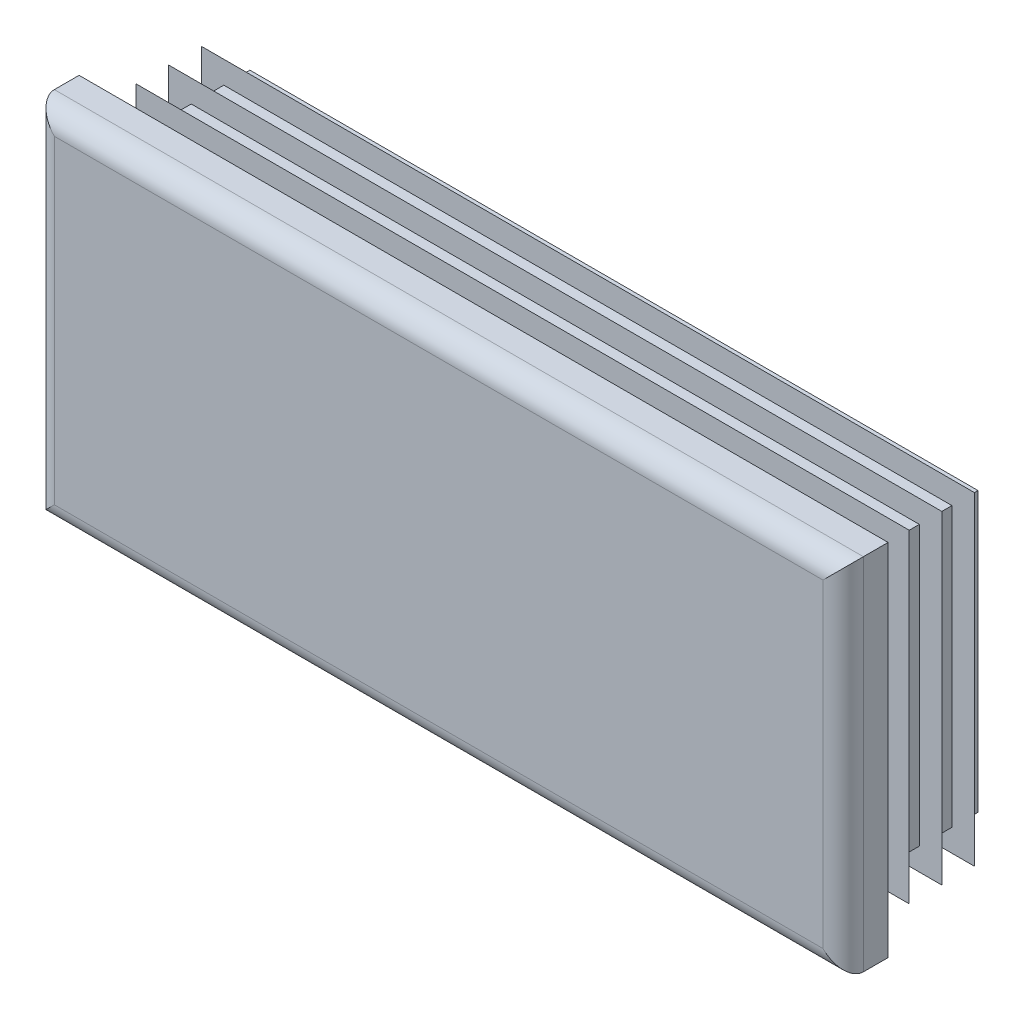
ISO-10303-21;
HEADER;
FILE_DESCRIPTION(('STEP AP214'),'2;1');
FILE_NAME('part.step','',(''),(''),'','','');
FILE_SCHEMA(('AUTOMOTIVE_DESIGN { 1 0 10303 214 1 1 1 1 }'));
ENDSEC;
DATA;
#1=APPLICATION_CONTEXT('core data for automotive mechanical design processes');
#2=APPLICATION_PROTOCOL_DEFINITION('international standard','automotive_design',2000,#1);
#3=PRODUCT_CONTEXT('',#1,'mechanical');
#4=PRODUCT('Part','Part','',(#3));
#5=PRODUCT_RELATED_PRODUCT_CATEGORY('part','',(#4));
#6=PRODUCT_DEFINITION_FORMATION('','',#4);
#7=PRODUCT_DEFINITION_CONTEXT('part definition',#1,'design');
#8=PRODUCT_DEFINITION('design','',#6,#7);
#9=PRODUCT_DEFINITION_SHAPE('','',#8);
#10=(LENGTH_UNIT() NAMED_UNIT(*) SI_UNIT(.MILLI.,.METRE.));
#11=(NAMED_UNIT(*) PLANE_ANGLE_UNIT() SI_UNIT($,.RADIAN.));
#12=(NAMED_UNIT(*) SI_UNIT($,.STERADIAN.) SOLID_ANGLE_UNIT());
#13=UNCERTAINTY_MEASURE_WITH_UNIT(LENGTH_MEASURE(1.E-05),#10,'distance_accuracy_value','');
#14=(GEOMETRIC_REPRESENTATION_CONTEXT(3) GLOBAL_UNCERTAINTY_ASSIGNED_CONTEXT((#13)) GLOBAL_UNIT_ASSIGNED_CONTEXT((#10,
#11,#12)) REPRESENTATION_CONTEXT('',''));
#15=CARTESIAN_POINT('',(0.,0.,0.));
#16=DIRECTION('',(0.,0.,1.));
#17=DIRECTION('',(1.,0.,0.));
#18=AXIS2_PLACEMENT_3D('',#15,#16,#17);
#19=CARTESIAN_POINT('',(42.75,-20.,5.));
#20=DIRECTION('',(0.,0.,-1.));
#21=DIRECTION('',(0.,1.,0.));
#22=AXIS2_PLACEMENT_3D('',#19,#20,#21);
#23=PLANE('',#22);
#24=DIRECTION('',(0.,1.,0.));
#25=VECTOR('',#24,1.);
#26=CARTESIAN_POINT('',(-42.75,-20.,5.));
#27=LINE('',#26,#25);
#28=CARTESIAN_POINT('',(-42.75,-17.75,5.));
#29=VERTEX_POINT('',#28);
#30=CARTESIAN_POINT('',(-42.75,17.75,5.));
#31=VERTEX_POINT('',#30);
#32=EDGE_CURVE('E310',#29,#31,#27,.T.);
#33=ORIENTED_EDGE('',*,*,#32,.F.);
#34=DIRECTION('',(-1.,0.,0.));
#35=VECTOR('',#34,1.);
#36=CARTESIAN_POINT('',(45.,-17.75,5.));
#37=LINE('',#36,#35);
#38=CARTESIAN_POINT('',(42.75,-17.75,5.));
#39=VERTEX_POINT('',#38);
#40=EDGE_CURVE('E482',#39,#29,#37,.T.);
#41=ORIENTED_EDGE('',*,*,#40,.F.);
#42=DIRECTION('',(0.,1.,0.));
#43=VECTOR('',#42,1.);
#44=CARTESIAN_POINT('',(42.75,-20.,5.));
#45=LINE('',#44,#43);
#46=CARTESIAN_POINT('',(42.75,17.75,5.));
#47=VERTEX_POINT('',#46);
#48=EDGE_CURVE('E305',#39,#47,#45,.T.);
#49=ORIENTED_EDGE('',*,*,#48,.T.);
#50=DIRECTION('',(-1.,0.,0.));
#51=VECTOR('',#50,1.);
#52=CARTESIAN_POINT('',(45.,17.75,5.));
#53=LINE('',#52,#51);
#54=EDGE_CURVE('E630',#47,#31,#53,.T.);
#55=ORIENTED_EDGE('',*,*,#54,.T.);
#56=EDGE_LOOP('',(#33,#41,#49,#55));
#57=FACE_BOUND('',#56,.T.);
#58=ADVANCED_FACE('F14',(#57),#23,.F.);
#59=CARTESIAN_POINT('',(-42.75,-20.,2.75));
#60=DIRECTION('',(0.,1.,0.));
#61=DIRECTION('',(-1.,0.,0.));
#62=AXIS2_PLACEMENT_3D('',#59,#60,#61);
#63=CYLINDRICAL_SURFACE('',#62,2.25);
#64=DIRECTION('',(0.,1.,0.));
#65=VECTOR('',#64,1.);
#66=CARTESIAN_POINT('',(-45.,-20.,2.75));
#67=LINE('',#66,#65);
#68=CARTESIAN_POINT('',(-45.,-20.,2.75));
#69=VERTEX_POINT('',#68);
#70=CARTESIAN_POINT('',(-45.,20.,2.75));
#71=VERTEX_POINT('',#70);
#72=EDGE_CURVE('E402',#69,#71,#67,.T.);
#73=ORIENTED_EDGE('',*,*,#72,.F.);
#74=CARTESIAN_POINT('',(-42.75,-17.75,2.75));
#75=DIRECTION('',(-0.707106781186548,0.707106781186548,0.));
#76=DIRECTION('',(0.707106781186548,0.707106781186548,0.));
#77=AXIS2_PLACEMENT_3D('',#74,#75,#76);
#78=ELLIPSE('',#77,3.18198051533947,2.25);
#79=EDGE_CURVE('E59',#69,#29,#78,.T.);
#80=ORIENTED_EDGE('',*,*,#79,.T.);
#81=ORIENTED_EDGE('',*,*,#32,.T.);
#82=CARTESIAN_POINT('',(-42.75,17.75,2.75));
#83=DIRECTION('',(0.707106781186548,0.707106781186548,0.));
#84=DIRECTION('',(-0.707106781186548,0.707106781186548,0.));
#85=AXIS2_PLACEMENT_3D('',#82,#83,#84);
#86=ELLIPSE('',#85,3.18198051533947,2.25);
#87=EDGE_CURVE('E306',#31,#71,#86,.F.);
#88=ORIENTED_EDGE('',*,*,#87,.T.);
#89=EDGE_LOOP('',(#73,#80,#81,#88));
#90=FACE_BOUND('',#89,.T.);
#91=ADVANCED_FACE('F16',(#90),#63,.T.);
#92=CARTESIAN_POINT('',(-45.,-20.,2.75));
#93=DIRECTION('',(1.,0.,0.));
#94=DIRECTION('',(0.,1.,0.));
#95=AXIS2_PLACEMENT_3D('',#92,#93,#94);
#96=PLANE('',#95);
#97=DIRECTION('',(0.,0.,-1.));
#98=VECTOR('',#97,1.);
#99=CARTESIAN_POINT('',(-45.,20.,2.75));
#100=LINE('',#99,#98);
#101=CARTESIAN_POINT('',(-45.,20.,0.));
#102=VERTEX_POINT('',#101);
#103=EDGE_CURVE('E615',#71,#102,#100,.T.);
#104=ORIENTED_EDGE('',*,*,#103,.T.);
#105=DIRECTION('',(0.,1.,0.));
#106=VECTOR('',#105,1.);
#107=CARTESIAN_POINT('',(-45.,-20.,0.));
#108=LINE('',#107,#106);
#109=CARTESIAN_POINT('',(-45.,-20.,0.));
#110=VERTEX_POINT('',#109);
#111=EDGE_CURVE('E400',#110,#102,#108,.T.);
#112=ORIENTED_EDGE('',*,*,#111,.F.);
#113=DIRECTION('',(0.,0.,-1.));
#114=VECTOR('',#113,1.);
#115=CARTESIAN_POINT('',(-45.,-20.,2.75));
#116=LINE('',#115,#114);
#117=EDGE_CURVE('E616',#69,#110,#116,.T.);
#118=ORIENTED_EDGE('',*,*,#117,.F.);
#119=ORIENTED_EDGE('',*,*,#72,.T.);
#120=EDGE_LOOP('',(#104,#112,#118,#119));
#121=FACE_BOUND('',#120,.T.);
#122=ADVANCED_FACE('F697',(#121),#96,.F.);
#123=CARTESIAN_POINT('',(-40.5,-20.,0.));
#124=DIRECTION('',(1.,0.,0.));
#125=DIRECTION('',(0.,1.,0.));
#126=AXIS2_PLACEMENT_3D('',#123,#124,#125);
#127=PLANE('',#126);
#128=DIRECTION('',(0.,1.,0.));
#129=VECTOR('',#128,1.);
#130=CARTESIAN_POINT('',(-40.5,-20.,0.));
#131=LINE('',#130,#129);
#132=CARTESIAN_POINT('',(-40.5,-15.5,0.));
#133=VERTEX_POINT('',#132);
#134=CARTESIAN_POINT('',(-40.5,15.5,0.));
#135=VERTEX_POINT('',#134);
#136=EDGE_CURVE('E397',#133,#135,#131,.T.);
#137=ORIENTED_EDGE('',*,*,#136,.T.);
#138=DIRECTION('',(0.,0.,-1.));
#139=VECTOR('',#138,1.);
#140=CARTESIAN_POINT('',(-40.5,15.5,0.));
#141=LINE('',#140,#139);
#142=CARTESIAN_POINT('',(-40.5,15.5,-0.725));
#143=VERTEX_POINT('',#142);
#144=EDGE_CURVE('E495',#135,#143,#141,.T.);
#145=ORIENTED_EDGE('',*,*,#144,.T.);
#146=DIRECTION('',(0.,1.,0.));
#147=VECTOR('',#146,1.);
#148=CARTESIAN_POINT('',(-40.5,-20.,-0.725));
#149=LINE('',#148,#147);
#150=CARTESIAN_POINT('',(-40.5,-15.5,-0.725));
#151=VERTEX_POINT('',#150);
#152=EDGE_CURVE('E394',#151,#143,#149,.T.);
#153=ORIENTED_EDGE('',*,*,#152,.F.);
#154=DIRECTION('',(0.,0.,1.));
#155=VECTOR('',#154,1.);
#156=CARTESIAN_POINT('',(-40.5,-15.5,0.));
#157=LINE('',#156,#155);
#158=EDGE_CURVE('E489',#151,#133,#157,.T.);
#159=ORIENTED_EDGE('',*,*,#158,.T.);
#160=EDGE_LOOP('',(#137,#145,#153,#159));
#161=FACE_BOUND('',#160,.T.);
#162=ADVANCED_FACE('F787',(#161),#127,.F.);
#163=CARTESIAN_POINT('',(-43.,-20.,-0.725));
#164=DIRECTION('',(0.34202014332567,0.,0.939692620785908));
#165=DIRECTION('',(-0.939692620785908,0.,0.34202014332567));
#166=AXIS2_PLACEMENT_3D('',#163,#164,#165);
#167=PLANE('',#166);
#168=DIRECTION('',(0.,1.,0.));
#169=VECTOR('',#168,1.);
#170=CARTESIAN_POINT('',(-43.,-20.,-0.725));
#171=LINE('',#170,#169);
#172=CARTESIAN_POINT('',(-43.,-18.,-0.725));
#173=VERTEX_POINT('',#172);
#174=CARTESIAN_POINT('',(-43.,18.,-0.725));
#175=VERTEX_POINT('',#174);
#176=EDGE_CURVE('E392',#173,#175,#171,.T.);
#177=ORIENTED_EDGE('',*,*,#176,.T.);
#178=DIRECTION('',(0.844349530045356,-0.438895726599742,-0.307318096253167));
#179=VECTOR('',#178,1.);
#180=CARTESIAN_POINT('',(-28.9179067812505,10.6800805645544,-5.85046276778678));
#181=LINE('',#180,#179);
#182=CARTESIAN_POINT('',(-40.5,16.7004915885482,-1.63492558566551));
#183=VERTEX_POINT('',#182);
#184=EDGE_CURVE('E519',#175,#183,#181,.T.);
#185=ORIENTED_EDGE('',*,*,#184,.T.);
#186=DIRECTION('',(0.,1.,0.));
#187=VECTOR('',#186,1.);
#188=CARTESIAN_POINT('',(-40.5,-20.,-1.63492558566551));
#189=LINE('',#188,#187);
#190=CARTESIAN_POINT('',(-40.5,-16.7004915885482,-1.63492558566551));
#191=VERTEX_POINT('',#190);
#192=EDGE_CURVE('E389',#191,#183,#189,.T.);
#193=ORIENTED_EDGE('',*,*,#192,.F.);
#194=DIRECTION('',(-0.844349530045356,-0.438895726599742,0.307318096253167));
#195=VECTOR('',#194,1.);
#196=CARTESIAN_POINT('',(-43.7411628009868,-18.3852589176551,-0.455238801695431));
#197=LINE('',#196,#195);
#198=EDGE_CURVE('E507',#191,#173,#197,.T.);
#199=ORIENTED_EDGE('',*,*,#198,.T.);
#200=EDGE_LOOP('',(#177,#185,#193,#199));
#201=FACE_BOUND('',#200,.T.);
#202=ADVANCED_FACE('F783',(#201),#167,.F.);
#203=CARTESIAN_POINT('',(-40.5,-20.,-1.63492558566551));
#204=DIRECTION('',(1.,0.,0.));
#205=DIRECTION('',(0.,1.,0.));
#206=AXIS2_PLACEMENT_3D('',#203,#204,#205);
#207=PLANE('',#206);
#208=ORIENTED_EDGE('',*,*,#192,.T.);
#209=DIRECTION('',(0.,-0.819152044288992,-0.573576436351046));
#210=VECTOR('',#209,1.);
#211=CARTESIAN_POINT('',(-40.5,-7.92590790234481,-18.8785161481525));
#212=LINE('',#211,#210);
#213=CARTESIAN_POINT('',(-40.5,15.5,-2.47551884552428));
#214=VERTEX_POINT('',#213);
#215=EDGE_CURVE('E516',#183,#214,#212,.T.);
#216=ORIENTED_EDGE('',*,*,#215,.T.);
#217=DIRECTION('',(0.,0.,-1.));
#218=VECTOR('',#217,1.);
#219=CARTESIAN_POINT('',(-40.5,15.5,-1.63492558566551));
#220=LINE('',#219,#218);
#221=CARTESIAN_POINT('',(-40.5,15.5,-4.35));
#222=VERTEX_POINT('',#221);
#223=EDGE_CURVE('E525',#214,#222,#220,.T.);
#224=ORIENTED_EDGE('',*,*,#223,.T.);
#225=DIRECTION('',(0.,1.,0.));
#226=VECTOR('',#225,1.);
#227=CARTESIAN_POINT('',(-40.5,-20.,-4.35));
#228=LINE('',#227,#226);
#229=CARTESIAN_POINT('',(-40.5,-15.5,-4.35));
#230=VERTEX_POINT('',#229);
#231=EDGE_CURVE('E386',#230,#222,#228,.T.);
#232=ORIENTED_EDGE('',*,*,#231,.F.);
#233=DIRECTION('',(0.,0.,1.));
#234=VECTOR('',#233,1.);
#235=CARTESIAN_POINT('',(-40.5,-15.5,-1.63492558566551));
#236=LINE('',#235,#234);
#237=CARTESIAN_POINT('',(-40.5,-15.5,-2.47551884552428));
#238=VERTEX_POINT('',#237);
#239=EDGE_CURVE('E522',#230,#238,#236,.T.);
#240=ORIENTED_EDGE('',*,*,#239,.T.);
#241=DIRECTION('',(0.,-0.819152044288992,0.573576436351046));
#242=VECTOR('',#241,1.);
#243=CARTESIAN_POINT('',(-40.5,-18.9144949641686,-0.0846637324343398));
#244=LINE('',#243,#242);
#245=EDGE_CURVE('E504',#238,#191,#244,.T.);
#246=ORIENTED_EDGE('',*,*,#245,.T.);
#247=EDGE_LOOP('',(#208,#216,#224,#232,#240,#246));
#248=FACE_BOUND('',#247,.T.);
#249=ADVANCED_FACE('F779',(#248),#207,.F.);
#250=CARTESIAN_POINT('',(-43.,-20.,-4.35));
#251=DIRECTION('',(0.34202014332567,0.,0.939692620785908));
#252=DIRECTION('',(-0.939692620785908,0.,0.34202014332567));
#253=AXIS2_PLACEMENT_3D('',#250,#251,#252);
#254=PLANE('',#253);
#255=DIRECTION('',(0.,1.,0.));
#256=VECTOR('',#255,1.);
#257=CARTESIAN_POINT('',(-43.,-20.,-4.35));
#258=LINE('',#257,#256);
#259=CARTESIAN_POINT('',(-43.,-18.,-4.35));
#260=VERTEX_POINT('',#259);
#261=CARTESIAN_POINT('',(-43.,18.,-4.35));
#262=VERTEX_POINT('',#261);
#263=EDGE_CURVE('E384',#260,#262,#258,.T.);
#264=ORIENTED_EDGE('',*,*,#263,.T.);
#265=DIRECTION('',(0.844349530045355,-0.438895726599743,-0.307318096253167));
#266=VECTOR('',#265,1.);
#267=CARTESIAN_POINT('',(-28.9179067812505,10.6800805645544,-9.47546276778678));
#268=LINE('',#267,#266);
#269=CARTESIAN_POINT('',(-40.5,16.7004915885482,-5.25992558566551));
#270=VERTEX_POINT('',#269);
#271=EDGE_CURVE('E549',#262,#270,#268,.T.);
#272=ORIENTED_EDGE('',*,*,#271,.T.);
#273=DIRECTION('',(0.,1.,0.));
#274=VECTOR('',#273,1.);
#275=CARTESIAN_POINT('',(-40.5,-20.,-5.25992558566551));
#276=LINE('',#275,#274);
#277=CARTESIAN_POINT('',(-40.5,-16.7004915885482,-5.25992558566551));
#278=VERTEX_POINT('',#277);
#279=EDGE_CURVE('E381',#278,#270,#276,.T.);
#280=ORIENTED_EDGE('',*,*,#279,.F.);
#281=DIRECTION('',(-0.844349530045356,-0.438895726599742,0.307318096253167));
#282=VECTOR('',#281,1.);
#283=CARTESIAN_POINT('',(-43.7411628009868,-18.3852589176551,-4.08023880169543));
#284=LINE('',#283,#282);
#285=EDGE_CURVE('E537',#278,#260,#284,.T.);
#286=ORIENTED_EDGE('',*,*,#285,.T.);
#287=EDGE_LOOP('',(#264,#272,#280,#286));
#288=FACE_BOUND('',#287,.T.);
#289=ADVANCED_FACE('F775',(#288),#254,.F.);
#290=CARTESIAN_POINT('',(-40.5,-20.,-5.25992558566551));
#291=DIRECTION('',(1.,0.,0.));
#292=DIRECTION('',(0.,1.,0.));
#293=AXIS2_PLACEMENT_3D('',#290,#291,#292);
#294=PLANE('',#293);
#295=ORIENTED_EDGE('',*,*,#279,.T.);
#296=DIRECTION('',(0.,-0.819152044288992,-0.573576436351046));
#297=VECTOR('',#296,1.);
#298=CARTESIAN_POINT('',(-40.5,-7.92590790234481,-22.5035161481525));
#299=LINE('',#298,#297);
#300=CARTESIAN_POINT('',(-40.5,15.5,-6.10051884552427));
#301=VERTEX_POINT('',#300);
#302=EDGE_CURVE('E546',#270,#301,#299,.T.);
#303=ORIENTED_EDGE('',*,*,#302,.T.);
#304=DIRECTION('',(0.,0.,-1.));
#305=VECTOR('',#304,1.);
#306=CARTESIAN_POINT('',(-40.5,15.5,-5.25992558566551));
#307=LINE('',#306,#305);
#308=CARTESIAN_POINT('',(-40.5,15.5,-7.975));
#309=VERTEX_POINT('',#308);
#310=EDGE_CURVE('E555',#301,#309,#307,.T.);
#311=ORIENTED_EDGE('',*,*,#310,.T.);
#312=DIRECTION('',(0.,1.,0.));
#313=VECTOR('',#312,1.);
#314=CARTESIAN_POINT('',(-40.5,-20.,-7.975));
#315=LINE('',#314,#313);
#316=CARTESIAN_POINT('',(-40.5,-15.5,-7.975));
#317=VERTEX_POINT('',#316);
#318=EDGE_CURVE('E378',#317,#309,#315,.T.);
#319=ORIENTED_EDGE('',*,*,#318,.F.);
#320=DIRECTION('',(0.,0.,1.));
#321=VECTOR('',#320,1.);
#322=CARTESIAN_POINT('',(-40.5,-15.5,-5.25992558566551));
#323=LINE('',#322,#321);
#324=CARTESIAN_POINT('',(-40.5,-15.5,-6.10051884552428));
#325=VERTEX_POINT('',#324);
#326=EDGE_CURVE('E552',#317,#325,#323,.T.);
#327=ORIENTED_EDGE('',*,*,#326,.T.);
#328=DIRECTION('',(0.,-0.819152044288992,0.573576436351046));
#329=VECTOR('',#328,1.);
#330=CARTESIAN_POINT('',(-40.5,-18.9144949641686,-3.70966373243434));
#331=LINE('',#330,#329);
#332=EDGE_CURVE('E534',#325,#278,#331,.T.);
#333=ORIENTED_EDGE('',*,*,#332,.T.);
#334=EDGE_LOOP('',(#295,#303,#311,#319,#327,#333));
#335=FACE_BOUND('',#334,.T.);
#336=ADVANCED_FACE('F771',(#335),#294,.F.);
#337=CARTESIAN_POINT('',(-43.,-20.,-7.975));
#338=DIRECTION('',(0.342020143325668,0.,0.939692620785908));
#339=DIRECTION('',(-0.939692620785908,0.,0.342020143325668));
#340=AXIS2_PLACEMENT_3D('',#337,#338,#339);
#341=PLANE('',#340);
#342=DIRECTION('',(0.,1.,0.));
#343=VECTOR('',#342,1.);
#344=CARTESIAN_POINT('',(-43.,-20.,-7.975));
#345=LINE('',#344,#343);
#346=CARTESIAN_POINT('',(-43.,-18.,-7.975));
#347=VERTEX_POINT('',#346);
#348=CARTESIAN_POINT('',(-43.,18.,-7.975));
#349=VERTEX_POINT('',#348);
#350=EDGE_CURVE('E376',#347,#349,#345,.T.);
#351=ORIENTED_EDGE('',*,*,#350,.T.);
#352=DIRECTION('',(0.844349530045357,-0.438895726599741,-0.307318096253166));
#353=VECTOR('',#352,1.);
#354=CARTESIAN_POINT('',(-28.9179067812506,10.6800805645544,-13.1004627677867));
#355=LINE('',#354,#353);
#356=CARTESIAN_POINT('',(-40.5,16.7004915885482,-8.8849255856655));
#357=VERTEX_POINT('',#356);
#358=EDGE_CURVE('E579',#349,#357,#355,.T.);
#359=ORIENTED_EDGE('',*,*,#358,.T.);
#360=DIRECTION('',(0.,1.,0.));
#361=VECTOR('',#360,1.);
#362=CARTESIAN_POINT('',(-40.5,-20.,-8.88492558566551));
#363=LINE('',#362,#361);
#364=CARTESIAN_POINT('',(-40.5,-16.7004915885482,-8.88492558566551));
#365=VERTEX_POINT('',#364);
#366=EDGE_CURVE('E373',#365,#357,#363,.T.);
#367=ORIENTED_EDGE('',*,*,#366,.F.);
#368=DIRECTION('',(-0.844349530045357,-0.438895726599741,0.307318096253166));
#369=VECTOR('',#368,1.);
#370=CARTESIAN_POINT('',(-43.7411628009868,-18.3852589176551,-7.70523880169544));
#371=LINE('',#370,#369);
#372=EDGE_CURVE('E567',#365,#347,#371,.T.);
#373=ORIENTED_EDGE('',*,*,#372,.T.);
#374=EDGE_LOOP('',(#351,#359,#367,#373));
#375=FACE_BOUND('',#374,.T.);
#376=ADVANCED_FACE('F767',(#375),#341,.F.);
#377=CARTESIAN_POINT('',(-40.5,-20.,-8.88492558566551));
#378=DIRECTION('',(1.,0.,0.));
#379=DIRECTION('',(0.,1.,0.));
#380=AXIS2_PLACEMENT_3D('',#377,#378,#379);
#381=PLANE('',#380);
#382=ORIENTED_EDGE('',*,*,#366,.T.);
#383=DIRECTION('',(0.,-0.819152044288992,-0.573576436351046));
#384=VECTOR('',#383,1.);
#385=CARTESIAN_POINT('',(-40.5,-7.9259079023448,-26.1285161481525));
#386=LINE('',#385,#384);
#387=CARTESIAN_POINT('',(-40.5,15.5,-9.72551884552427));
#388=VERTEX_POINT('',#387);
#389=EDGE_CURVE('E576',#357,#388,#386,.T.);
#390=ORIENTED_EDGE('',*,*,#389,.T.);
#391=DIRECTION('',(0.,0.,-1.));
#392=VECTOR('',#391,1.);
#393=CARTESIAN_POINT('',(-40.5,15.5,-8.88492558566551));
#394=LINE('',#393,#392);
#395=CARTESIAN_POINT('',(-40.5,15.5,-11.6));
#396=VERTEX_POINT('',#395);
#397=EDGE_CURVE('E585',#388,#396,#394,.T.);
#398=ORIENTED_EDGE('',*,*,#397,.T.);
#399=DIRECTION('',(0.,1.,0.));
#400=VECTOR('',#399,1.);
#401=CARTESIAN_POINT('',(-40.5,-20.,-11.6));
#402=LINE('',#401,#400);
#403=CARTESIAN_POINT('',(-40.5,-15.5,-11.6));
#404=VERTEX_POINT('',#403);
#405=EDGE_CURVE('E370',#404,#396,#402,.T.);
#406=ORIENTED_EDGE('',*,*,#405,.F.);
#407=DIRECTION('',(0.,0.,1.));
#408=VECTOR('',#407,1.);
#409=CARTESIAN_POINT('',(-40.5,-15.5,-8.88492558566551));
#410=LINE('',#409,#408);
#411=CARTESIAN_POINT('',(-40.5,-15.5,-9.72551884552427));
#412=VERTEX_POINT('',#411);
#413=EDGE_CURVE('E582',#404,#412,#410,.T.);
#414=ORIENTED_EDGE('',*,*,#413,.T.);
#415=DIRECTION('',(0.,-0.819152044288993,0.573576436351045));
#416=VECTOR('',#415,1.);
#417=CARTESIAN_POINT('',(-40.5,-18.9144949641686,-7.33466373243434));
#418=LINE('',#417,#416);
#419=EDGE_CURVE('E564',#412,#365,#418,.T.);
#420=ORIENTED_EDGE('',*,*,#419,.T.);
#421=EDGE_LOOP('',(#382,#390,#398,#406,#414,#420));
#422=FACE_BOUND('',#421,.T.);
#423=ADVANCED_FACE('F764',(#422),#381,.F.);
#424=CARTESIAN_POINT('',(-43.,-20.,-11.6));
#425=DIRECTION('',(0.342020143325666,0.,0.939692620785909));
#426=DIRECTION('',(-0.939692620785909,0.,0.342020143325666));
#427=AXIS2_PLACEMENT_3D('',#424,#425,#426);
#428=PLANE('',#427);
#429=DIRECTION('',(0.,1.,0.));
#430=VECTOR('',#429,1.);
#431=CARTESIAN_POINT('',(-43.,-20.,-11.6));
#432=LINE('',#431,#430);
#433=CARTESIAN_POINT('',(-43.,-18.,-11.6));
#434=VERTEX_POINT('',#433);
#435=CARTESIAN_POINT('',(-43.,18.,-11.6));
#436=VERTEX_POINT('',#435);
#437=EDGE_CURVE('E368',#434,#436,#432,.T.);
#438=ORIENTED_EDGE('',*,*,#437,.T.);
#439=DIRECTION('',(0.844349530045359,-0.438895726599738,-0.307318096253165));
#440=VECTOR('',#439,1.);
#441=CARTESIAN_POINT('',(-28.9179067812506,10.6800805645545,-16.7254627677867));
#442=LINE('',#441,#440);
#443=CARTESIAN_POINT('',(-40.5,16.7004915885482,-12.5099255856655));
#444=VERTEX_POINT('',#443);
#445=EDGE_CURVE('E607',#436,#444,#442,.T.);
#446=ORIENTED_EDGE('',*,*,#445,.T.);
#447=DIRECTION('',(0.,1.,0.));
#448=VECTOR('',#447,1.);
#449=CARTESIAN_POINT('',(-40.5,-20.,-12.5099255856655));
#450=LINE('',#449,#448);
#451=CARTESIAN_POINT('',(-40.5,-16.7004915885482,-12.5099255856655));
#452=VERTEX_POINT('',#451);
#453=EDGE_CURVE('E365',#452,#444,#450,.T.);
#454=ORIENTED_EDGE('',*,*,#453,.F.);
#455=DIRECTION('',(-0.844349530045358,-0.438895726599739,0.307318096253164));
#456=VECTOR('',#455,1.);
#457=CARTESIAN_POINT('',(-43.7411628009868,-18.385258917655,-11.3302388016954));
#458=LINE('',#457,#456);
#459=EDGE_CURVE('E595',#452,#434,#458,.T.);
#460=ORIENTED_EDGE('',*,*,#459,.T.);
#461=EDGE_LOOP('',(#438,#446,#454,#460));
#462=FACE_BOUND('',#461,.T.);
#463=ADVANCED_FACE('F675',(#462),#428,.F.);
#464=CARTESIAN_POINT('',(-40.5,-20.,-12.5099255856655));
#465=DIRECTION('',(1.,0.,0.));
#466=DIRECTION('',(0.,1.,0.));
#467=AXIS2_PLACEMENT_3D('',#464,#465,#466);
#468=PLANE('',#467);
#469=ORIENTED_EDGE('',*,*,#453,.T.);
#470=DIRECTION('',(0.,-0.819152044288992,-0.573576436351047));
#471=VECTOR('',#470,1.);
#472=CARTESIAN_POINT('',(-40.5,-7.92590790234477,-29.7535161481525));
#473=LINE('',#472,#471);
#474=CARTESIAN_POINT('',(-40.5,15.5,-13.3505188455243));
#475=VERTEX_POINT('',#474);
#476=EDGE_CURVE('E604',#444,#475,#473,.T.);
#477=ORIENTED_EDGE('',*,*,#476,.T.);
#478=DIRECTION('',(0.,0.,-1.));
#479=VECTOR('',#478,1.);
#480=CARTESIAN_POINT('',(-40.5,15.5,-12.5099255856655));
#481=LINE('',#480,#479);
#482=CARTESIAN_POINT('',(-40.5,15.5,-14.5));
#483=VERTEX_POINT('',#482);
#484=EDGE_CURVE('E613',#475,#483,#481,.T.);
#485=ORIENTED_EDGE('',*,*,#484,.T.);
#486=DIRECTION('',(0.,1.,0.));
#487=VECTOR('',#486,1.);
#488=CARTESIAN_POINT('',(-40.5,-20.,-14.5));
#489=LINE('',#488,#487);
#490=CARTESIAN_POINT('',(-40.5,-15.5,-14.5));
#491=VERTEX_POINT('',#490);
#492=EDGE_CURVE('E362',#491,#483,#489,.T.);
#493=ORIENTED_EDGE('',*,*,#492,.F.);
#494=DIRECTION('',(0.,0.,1.));
#495=VECTOR('',#494,1.);
#496=CARTESIAN_POINT('',(-40.5,-15.5,-12.5099255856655));
#497=LINE('',#496,#495);
#498=CARTESIAN_POINT('',(-40.5,-15.5,-13.3505188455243));
#499=VERTEX_POINT('',#498);
#500=EDGE_CURVE('E610',#491,#499,#497,.T.);
#501=ORIENTED_EDGE('',*,*,#500,.T.);
#502=DIRECTION('',(0.,-0.819152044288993,0.573576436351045));
#503=VECTOR('',#502,1.);
#504=CARTESIAN_POINT('',(-40.5,-18.9144949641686,-10.9596637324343));
#505=LINE('',#504,#503);
#506=EDGE_CURVE('E592',#499,#452,#505,.T.);
#507=ORIENTED_EDGE('',*,*,#506,.T.);
#508=EDGE_LOOP('',(#469,#477,#485,#493,#501,#507));
#509=FACE_BOUND('',#508,.T.);
#510=ADVANCED_FACE('F677',(#509),#468,.F.);
#511=CARTESIAN_POINT('',(-40.5,-20.,-14.5));
#512=DIRECTION('',(0.,0.,1.));
#513=DIRECTION('',(0.,-1.,0.));
#514=AXIS2_PLACEMENT_3D('',#511,#512,#513);
#515=PLANE('',#514);
#516=ORIENTED_EDGE('',*,*,#492,.T.);
#517=DIRECTION('',(-1.,0.,0.));
#518=VECTOR('',#517,1.);
#519=CARTESIAN_POINT('',(45.,15.5,-14.5));
#520=LINE('',#519,#518);
#521=CARTESIAN_POINT('',(40.5,15.5,-14.5));
#522=VERTEX_POINT('',#521);
#523=EDGE_CURVE('E438',#522,#483,#520,.T.);
#524=ORIENTED_EDGE('',*,*,#523,.F.);
#525=DIRECTION('',(0.,1.,0.));
#526=VECTOR('',#525,1.);
#527=CARTESIAN_POINT('',(40.5,-20.,-14.5));
#528=LINE('',#527,#526);
#529=CARTESIAN_POINT('',(40.5,-15.5,-14.5));
#530=VERTEX_POINT('',#529);
#531=EDGE_CURVE('E359',#530,#522,#528,.T.);
#532=ORIENTED_EDGE('',*,*,#531,.F.);
#533=DIRECTION('',(-1.,0.,0.));
#534=VECTOR('',#533,1.);
#535=CARTESIAN_POINT('',(45.,-15.5,-14.5));
#536=LINE('',#535,#534);
#537=EDGE_CURVE('E436',#530,#491,#536,.T.);
#538=ORIENTED_EDGE('',*,*,#537,.T.);
#539=EDGE_LOOP('',(#516,#524,#532,#538));
#540=FACE_BOUND('',#539,.T.);
#541=ADVANCED_FACE('F435',(#540),#515,.F.);
#542=CARTESIAN_POINT('',(40.5,-20.,-14.5));
#543=DIRECTION('',(-1.,0.,0.));
#544=DIRECTION('',(0.,-1.,0.));
#545=AXIS2_PLACEMENT_3D('',#542,#543,#544);
#546=PLANE('',#545);
#547=DIRECTION('',(0.,0.,1.));
#548=VECTOR('',#547,1.);
#549=CARTESIAN_POINT('',(40.5,15.5,-14.5));
#550=LINE('',#549,#548);
#551=CARTESIAN_POINT('',(40.5,15.5,-13.3505188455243));
#552=VERTEX_POINT('',#551);
#553=EDGE_CURVE('E9',#522,#552,#550,.T.);
#554=ORIENTED_EDGE('',*,*,#553,.T.);
#555=DIRECTION('',(0.,0.819152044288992,0.573576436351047));
#556=VECTOR('',#555,1.);
#557=CARTESIAN_POINT('',(40.5,-8.86093702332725,-30.4082305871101));
#558=LINE('',#557,#556);
#559=CARTESIAN_POINT('',(40.5,16.7004915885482,-12.5099255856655));
#560=VERTEX_POINT('',#559);
#561=EDGE_CURVE('E601',#552,#560,#558,.T.);
#562=ORIENTED_EDGE('',*,*,#561,.T.);
#563=DIRECTION('',(0.,1.,0.));
#564=VECTOR('',#563,1.);
#565=CARTESIAN_POINT('',(40.5,-20.,-12.5099255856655));
#566=LINE('',#565,#564);
#567=CARTESIAN_POINT('',(40.5,-16.7004915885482,-12.5099255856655));
#568=VERTEX_POINT('',#567);
#569=EDGE_CURVE('E356',#568,#560,#566,.T.);
#570=ORIENTED_EDGE('',*,*,#569,.F.);
#571=DIRECTION('',(0.,0.819152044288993,-0.573576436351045));
#572=VECTOR('',#571,1.);
#573=CARTESIAN_POINT('',(40.5,-17.9794658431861,-11.6143781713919));
#574=LINE('',#573,#572);
#575=CARTESIAN_POINT('',(40.5,-15.5,-13.3505188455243));
#576=VERTEX_POINT('',#575);
#577=EDGE_CURVE('E428',#568,#576,#574,.T.);
#578=ORIENTED_EDGE('',*,*,#577,.T.);
#579=DIRECTION('',(0.,0.,-1.));
#580=VECTOR('',#579,1.);
#581=CARTESIAN_POINT('',(40.5,-15.5,-14.5));
#582=LINE('',#581,#580);
#583=EDGE_CURVE('E23',#576,#530,#582,.T.);
#584=ORIENTED_EDGE('',*,*,#583,.T.);
#585=ORIENTED_EDGE('',*,*,#531,.T.);
#586=EDGE_LOOP('',(#554,#562,#570,#578,#584,#585));
#587=FACE_BOUND('',#586,.T.);
#588=ADVANCED_FACE('F426',(#587),#546,.F.);
#589=CARTESIAN_POINT('',(40.5,-20.,-12.5099255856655));
#590=DIRECTION('',(-0.342020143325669,0.,0.939692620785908));
#591=DIRECTION('',(-0.939692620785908,0.,-0.342020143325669));
#592=AXIS2_PLACEMENT_3D('',#589,#590,#591);
#593=PLANE('',#592);
#594=ORIENTED_EDGE('',*,*,#569,.T.);
#595=DIRECTION('',(0.844349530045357,0.43889572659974,0.307318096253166));
#596=VECTOR('',#595,1.);
#597=CARTESIAN_POINT('',(26.8994804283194,9.63089575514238,-17.4601098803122));
#598=LINE('',#597,#596);
#599=CARTESIAN_POINT('',(43.,18.,-11.6));
#600=VERTEX_POINT('',#599);
#601=EDGE_CURVE('E598',#560,#600,#598,.T.);
#602=ORIENTED_EDGE('',*,*,#601,.T.);
#603=DIRECTION('',(0.,1.,0.));
#604=VECTOR('',#603,1.);
#605=CARTESIAN_POINT('',(43.,-20.,-11.6));
#606=LINE('',#605,#604);
#607=CARTESIAN_POINT('',(43.,-18.,-11.6));
#608=VERTEX_POINT('',#607);
#609=EDGE_CURVE('E353',#608,#600,#606,.T.);
#610=ORIENTED_EDGE('',*,*,#609,.F.);
#611=DIRECTION('',(-0.844349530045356,0.438895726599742,-0.307318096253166));
#612=VECTOR('',#611,1.);
#613=CARTESIAN_POINT('',(41.7227364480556,-17.336074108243,-12.0648859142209));
#614=LINE('',#613,#612);
#615=EDGE_CURVE('E588',#608,#568,#614,.T.);
#616=ORIENTED_EDGE('',*,*,#615,.T.);
#617=EDGE_LOOP('',(#594,#602,#610,#616));
#618=FACE_BOUND('',#617,.T.);
#619=ADVANCED_FACE('F752',(#618),#593,.F.);
#620=CARTESIAN_POINT('',(43.,-20.,-11.6));
#621=DIRECTION('',(0.,0.,-1.));
#622=DIRECTION('',(0.,1.,0.));
#623=AXIS2_PLACEMENT_3D('',#620,#621,#622);
#624=PLANE('',#623);
#625=ORIENTED_EDGE('',*,*,#609,.T.);
#626=DIRECTION('',(-1.,0.,0.));
#627=VECTOR('',#626,1.);
#628=CARTESIAN_POINT('',(45.,18.,-11.6));
#629=LINE('',#628,#627);
#630=EDGE_CURVE('E444',#600,#436,#629,.T.);
#631=ORIENTED_EDGE('',*,*,#630,.T.);
#632=ORIENTED_EDGE('',*,*,#437,.F.);
#633=DIRECTION('',(-1.,0.,0.));
#634=VECTOR('',#633,1.);
#635=CARTESIAN_POINT('',(45.,-18.,-11.6));
#636=LINE('',#635,#634);
#637=EDGE_CURVE('E451',#608,#434,#636,.T.);
#638=ORIENTED_EDGE('',*,*,#637,.F.);
#639=EDGE_LOOP('',(#625,#631,#632,#638));
#640=FACE_BOUND('',#639,.T.);
#641=ORIENTED_EDGE('',*,*,#405,.T.);
#642=DIRECTION('',(-1.,0.,0.));
#643=VECTOR('',#642,1.);
#644=CARTESIAN_POINT('',(45.,15.5,-11.6));
#645=LINE('',#644,#643);
#646=CARTESIAN_POINT('',(40.5,15.5,-11.6));
#647=VERTEX_POINT('',#646);
#648=EDGE_CURVE('E663',#647,#396,#645,.T.);
#649=ORIENTED_EDGE('',*,*,#648,.F.);
#650=DIRECTION('',(0.,1.,0.));
#651=VECTOR('',#650,1.);
#652=CARTESIAN_POINT('',(40.5,-20.,-11.6));
#653=LINE('',#652,#651);
#654=CARTESIAN_POINT('',(40.5,-15.5,-11.6));
#655=VERTEX_POINT('',#654);
#656=EDGE_CURVE('E350',#655,#647,#653,.T.);
#657=ORIENTED_EDGE('',*,*,#656,.F.);
#658=DIRECTION('',(-1.,0.,0.));
#659=VECTOR('',#658,1.);
#660=CARTESIAN_POINT('',(45.,-15.5,-11.6));
#661=LINE('',#660,#659);
#662=EDGE_CURVE('E453',#655,#404,#661,.T.);
#663=ORIENTED_EDGE('',*,*,#662,.T.);
#664=EDGE_LOOP('',(#641,#649,#657,#663));
#665=FACE_BOUND('',#664,.T.);
#666=ADVANCED_FACE('F667',(#640,#665),#624,.F.);
#667=CARTESIAN_POINT('',(40.5,-20.,-11.6));
#668=DIRECTION('',(-1.,0.,0.));
#669=DIRECTION('',(0.,-1.,0.));
#670=AXIS2_PLACEMENT_3D('',#667,#668,#669);
#671=PLANE('',#670);
#672=DIRECTION('',(0.,0.,1.));
#673=VECTOR('',#672,1.);
#674=CARTESIAN_POINT('',(40.5,15.5,-11.6));
#675=LINE('',#674,#673);
#676=CARTESIAN_POINT('',(40.5,15.5,-9.72551884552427));
#677=VERTEX_POINT('',#676);
#678=EDGE_CURVE('E420',#647,#677,#675,.T.);
#679=ORIENTED_EDGE('',*,*,#678,.T.);
#680=DIRECTION('',(0.,0.819152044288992,0.573576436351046));
#681=VECTOR('',#680,1.);
#682=CARTESIAN_POINT('',(40.5,-9.20157559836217,-27.0217482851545));
#683=LINE('',#682,#681);
#684=CARTESIAN_POINT('',(40.5,16.7004915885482,-8.88492558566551));
#685=VERTEX_POINT('',#684);
#686=EDGE_CURVE('E573',#677,#685,#683,.T.);
#687=ORIENTED_EDGE('',*,*,#686,.T.);
#688=DIRECTION('',(0.,1.,0.));
#689=VECTOR('',#688,1.);
#690=CARTESIAN_POINT('',(40.5,-20.,-8.88492558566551));
#691=LINE('',#690,#689);
#692=CARTESIAN_POINT('',(40.5,-16.7004915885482,-8.88492558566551));
#693=VERTEX_POINT('',#692);
#694=EDGE_CURVE('E347',#693,#685,#691,.T.);
#695=ORIENTED_EDGE('',*,*,#694,.F.);
#696=DIRECTION('',(0.,0.819152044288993,-0.573576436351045));
#697=VECTOR('',#696,1.);
#698=CARTESIAN_POINT('',(40.5,-17.6388272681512,-8.22789586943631));
#699=LINE('',#698,#697);
#700=CARTESIAN_POINT('',(40.5,-15.5,-9.72551884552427));
#701=VERTEX_POINT('',#700);
#702=EDGE_CURVE('E561',#693,#701,#699,.T.);
#703=ORIENTED_EDGE('',*,*,#702,.T.);
#704=DIRECTION('',(0.,0.,-1.));
#705=VECTOR('',#704,1.);
#706=CARTESIAN_POINT('',(40.5,-15.5,-11.6));
#707=LINE('',#706,#705);
#708=EDGE_CURVE('E417',#701,#655,#707,.T.);
#709=ORIENTED_EDGE('',*,*,#708,.T.);
#710=ORIENTED_EDGE('',*,*,#656,.T.);
#711=EDGE_LOOP('',(#679,#687,#695,#703,#709,#710));
#712=FACE_BOUND('',#711,.T.);
#713=ADVANCED_FACE('F745',(#712),#671,.F.);
#714=CARTESIAN_POINT('',(40.5,-20.,-8.88492558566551));
#715=DIRECTION('',(-0.342020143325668,0.,0.939692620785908));
#716=DIRECTION('',(-0.939692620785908,0.,-0.342020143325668));
#717=AXIS2_PLACEMENT_3D('',#714,#715,#716);
#718=PLANE('',#717);
#719=ORIENTED_EDGE('',*,*,#694,.T.);
#720=DIRECTION('',(0.844349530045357,0.438895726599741,0.307318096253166));
#721=VECTOR('',#720,1.);
#722=CARTESIAN_POINT('',(26.8994804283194,9.63089575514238,-13.8351098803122));
#723=LINE('',#722,#721);
#724=CARTESIAN_POINT('',(43.,18.,-7.975));
#725=VERTEX_POINT('',#724);
#726=EDGE_CURVE('E570',#685,#725,#723,.T.);
#727=ORIENTED_EDGE('',*,*,#726,.T.);
#728=DIRECTION('',(0.,1.,0.));
#729=VECTOR('',#728,1.);
#730=CARTESIAN_POINT('',(43.,-20.,-7.975));
#731=LINE('',#730,#729);
#732=CARTESIAN_POINT('',(43.,-18.,-7.975));
#733=VERTEX_POINT('',#732);
#734=EDGE_CURVE('E344',#733,#725,#731,.T.);
#735=ORIENTED_EDGE('',*,*,#734,.F.);
#736=DIRECTION('',(-0.844349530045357,0.438895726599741,-0.307318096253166));
#737=VECTOR('',#736,1.);
#738=CARTESIAN_POINT('',(41.7227364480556,-17.336074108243,-8.43988591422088));
#739=LINE('',#738,#737);
#740=EDGE_CURVE('E558',#733,#693,#739,.T.);
#741=ORIENTED_EDGE('',*,*,#740,.T.);
#742=EDGE_LOOP('',(#719,#727,#735,#741));
#743=FACE_BOUND('',#742,.T.);
#744=ADVANCED_FACE('F741',(#743),#718,.F.);
#745=CARTESIAN_POINT('',(43.,-20.,-7.975));
#746=DIRECTION('',(0.,0.,-1.));
#747=DIRECTION('',(0.,1.,0.));
#748=AXIS2_PLACEMENT_3D('',#745,#746,#747);
#749=PLANE('',#748);
#750=ORIENTED_EDGE('',*,*,#734,.T.);
#751=DIRECTION('',(-1.,0.,0.));
#752=VECTOR('',#751,1.);
#753=CARTESIAN_POINT('',(45.,18.,-7.975));
#754=LINE('',#753,#752);
#755=EDGE_CURVE('E657',#725,#349,#754,.T.);
#756=ORIENTED_EDGE('',*,*,#755,.T.);
#757=ORIENTED_EDGE('',*,*,#350,.F.);
#758=DIRECTION('',(-1.,0.,0.));
#759=VECTOR('',#758,1.);
#760=CARTESIAN_POINT('',(45.,-18.,-7.975));
#761=LINE('',#760,#759);
#762=EDGE_CURVE('E459',#733,#347,#761,.T.);
#763=ORIENTED_EDGE('',*,*,#762,.F.);
#764=EDGE_LOOP('',(#750,#756,#757,#763));
#765=FACE_BOUND('',#764,.T.);
#766=ORIENTED_EDGE('',*,*,#318,.T.);
#767=DIRECTION('',(-1.,0.,0.));
#768=VECTOR('',#767,1.);
#769=CARTESIAN_POINT('',(45.,15.5,-7.975));
#770=LINE('',#769,#768);
#771=CARTESIAN_POINT('',(40.5,15.5,-7.975));
#772=VERTEX_POINT('',#771);
#773=EDGE_CURVE('E655',#772,#309,#770,.T.);
#774=ORIENTED_EDGE('',*,*,#773,.F.);
#775=DIRECTION('',(0.,1.,0.));
#776=VECTOR('',#775,1.);
#777=CARTESIAN_POINT('',(40.5,-20.,-7.975));
#778=LINE('',#777,#776);
#779=CARTESIAN_POINT('',(40.5,-15.5,-7.975));
#780=VERTEX_POINT('',#779);
#781=EDGE_CURVE('E341',#780,#772,#778,.T.);
#782=ORIENTED_EDGE('',*,*,#781,.F.);
#783=DIRECTION('',(-1.,0.,0.));
#784=VECTOR('',#783,1.);
#785=CARTESIAN_POINT('',(45.,-15.5,-7.975));
#786=LINE('',#785,#784);
#787=EDGE_CURVE('E461',#780,#317,#786,.T.);
#788=ORIENTED_EDGE('',*,*,#787,.T.);
#789=EDGE_LOOP('',(#766,#774,#782,#788));
#790=FACE_BOUND('',#789,.T.);
#791=ADVANCED_FACE('F737',(#765,#790),#749,.F.);
#792=CARTESIAN_POINT('',(40.5,-20.,-7.975));
#793=DIRECTION('',(-1.,0.,0.));
#794=DIRECTION('',(0.,-1.,0.));
#795=AXIS2_PLACEMENT_3D('',#792,#793,#794);
#796=PLANE('',#795);
#797=DIRECTION('',(0.,0.,1.));
#798=VECTOR('',#797,1.);
#799=CARTESIAN_POINT('',(40.5,15.5,-7.975));
#800=LINE('',#799,#798);
#801=CARTESIAN_POINT('',(40.5,15.5,-6.10051884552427));
#802=VERTEX_POINT('',#801);
#803=EDGE_CURVE('E414',#772,#802,#800,.T.);
#804=ORIENTED_EDGE('',*,*,#803,.T.);
#805=DIRECTION('',(0.,0.819152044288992,0.573576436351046));
#806=VECTOR('',#805,1.);
#807=CARTESIAN_POINT('',(40.5,-9.20157559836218,-23.3967482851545));
#808=LINE('',#807,#806);
#809=CARTESIAN_POINT('',(40.5,16.7004915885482,-5.25992558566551));
#810=VERTEX_POINT('',#809);
#811=EDGE_CURVE('E543',#802,#810,#808,.T.);
#812=ORIENTED_EDGE('',*,*,#811,.T.);
#813=DIRECTION('',(0.,1.,0.));
#814=VECTOR('',#813,1.);
#815=CARTESIAN_POINT('',(40.5,-20.,-5.25992558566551));
#816=LINE('',#815,#814);
#817=CARTESIAN_POINT('',(40.5,-16.7004915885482,-5.25992558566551));
#818=VERTEX_POINT('',#817);
#819=EDGE_CURVE('E338',#818,#810,#816,.T.);
#820=ORIENTED_EDGE('',*,*,#819,.F.);
#821=DIRECTION('',(0.,0.819152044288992,-0.573576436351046));
#822=VECTOR('',#821,1.);
#823=CARTESIAN_POINT('',(40.5,-17.6388272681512,-4.60289586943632));
#824=LINE('',#823,#822);
#825=CARTESIAN_POINT('',(40.5,-15.5,-6.10051884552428));
#826=VERTEX_POINT('',#825);
#827=EDGE_CURVE('E531',#818,#826,#824,.T.);
#828=ORIENTED_EDGE('',*,*,#827,.T.);
#829=DIRECTION('',(0.,0.,-1.));
#830=VECTOR('',#829,1.);
#831=CARTESIAN_POINT('',(40.5,-15.5,-7.975));
#832=LINE('',#831,#830);
#833=EDGE_CURVE('E411',#826,#780,#832,.T.);
#834=ORIENTED_EDGE('',*,*,#833,.T.);
#835=ORIENTED_EDGE('',*,*,#781,.T.);
#836=EDGE_LOOP('',(#804,#812,#820,#828,#834,#835));
#837=FACE_BOUND('',#836,.T.);
#838=ADVANCED_FACE('F733',(#837),#796,.F.);
#839=CARTESIAN_POINT('',(40.5,-20.,-5.25992558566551));
#840=DIRECTION('',(-0.342020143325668,0.,0.939692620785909));
#841=DIRECTION('',(-0.939692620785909,0.,-0.342020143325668));
#842=AXIS2_PLACEMENT_3D('',#839,#840,#841);
#843=PLANE('',#842);
#844=ORIENTED_EDGE('',*,*,#819,.T.);
#845=DIRECTION('',(0.844349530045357,0.438895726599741,0.307318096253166));
#846=VECTOR('',#845,1.);
#847=CARTESIAN_POINT('',(26.8994804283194,9.63089575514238,-10.2101098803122));
#848=LINE('',#847,#846);
#849=CARTESIAN_POINT('',(43.,18.,-4.35));
#850=VERTEX_POINT('',#849);
#851=EDGE_CURVE('E540',#810,#850,#848,.T.);
#852=ORIENTED_EDGE('',*,*,#851,.T.);
#853=DIRECTION('',(0.,1.,0.));
#854=VECTOR('',#853,1.);
#855=CARTESIAN_POINT('',(43.,-20.,-4.35));
#856=LINE('',#855,#854);
#857=CARTESIAN_POINT('',(43.,-18.,-4.35));
#858=VERTEX_POINT('',#857);
#859=EDGE_CURVE('E335',#858,#850,#856,.T.);
#860=ORIENTED_EDGE('',*,*,#859,.F.);
#861=DIRECTION('',(-0.844349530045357,0.43889572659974,-0.307318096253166));
#862=VECTOR('',#861,1.);
#863=CARTESIAN_POINT('',(41.7227364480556,-17.336074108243,-4.81488591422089));
#864=LINE('',#863,#862);
#865=EDGE_CURVE('E528',#858,#818,#864,.T.);
#866=ORIENTED_EDGE('',*,*,#865,.T.);
#867=EDGE_LOOP('',(#844,#852,#860,#866));
#868=FACE_BOUND('',#867,.T.);
#869=ADVANCED_FACE('F729',(#868),#843,.F.);
#870=CARTESIAN_POINT('',(43.,-20.,-4.35));
#871=DIRECTION('',(0.,0.,-1.));
#872=DIRECTION('',(0.,1.,0.));
#873=AXIS2_PLACEMENT_3D('',#870,#871,#872);
#874=PLANE('',#873);
#875=ORIENTED_EDGE('',*,*,#859,.T.);
#876=DIRECTION('',(-1.,0.,0.));
#877=VECTOR('',#876,1.);
#878=CARTESIAN_POINT('',(45.,18.,-4.35));
#879=LINE('',#878,#877);
#880=EDGE_CURVE('E649',#850,#262,#879,.T.);
#881=ORIENTED_EDGE('',*,*,#880,.T.);
#882=ORIENTED_EDGE('',*,*,#263,.F.);
#883=DIRECTION('',(-1.,0.,0.));
#884=VECTOR('',#883,1.);
#885=CARTESIAN_POINT('',(45.,-18.,-4.35));
#886=LINE('',#885,#884);
#887=EDGE_CURVE('E467',#858,#260,#886,.T.);
#888=ORIENTED_EDGE('',*,*,#887,.F.);
#889=EDGE_LOOP('',(#875,#881,#882,#888));
#890=FACE_BOUND('',#889,.T.);
#891=ORIENTED_EDGE('',*,*,#231,.T.);
#892=DIRECTION('',(-1.,0.,0.));
#893=VECTOR('',#892,1.);
#894=CARTESIAN_POINT('',(45.,15.5,-4.35));
#895=LINE('',#894,#893);
#896=CARTESIAN_POINT('',(40.5,15.5,-4.35));
#897=VERTEX_POINT('',#896);
#898=EDGE_CURVE('E647',#897,#222,#895,.T.);
#899=ORIENTED_EDGE('',*,*,#898,.F.);
#900=DIRECTION('',(0.,1.,0.));
#901=VECTOR('',#900,1.);
#902=CARTESIAN_POINT('',(40.5,-20.,-4.35));
#903=LINE('',#902,#901);
#904=CARTESIAN_POINT('',(40.5,-15.5,-4.35));
#905=VERTEX_POINT('',#904);
#906=EDGE_CURVE('E332',#905,#897,#903,.T.);
#907=ORIENTED_EDGE('',*,*,#906,.F.);
#908=DIRECTION('',(-1.,0.,0.));
#909=VECTOR('',#908,1.);
#910=CARTESIAN_POINT('',(45.,-15.5,-4.35));
#911=LINE('',#910,#909);
#912=EDGE_CURVE('E469',#905,#230,#911,.T.);
#913=ORIENTED_EDGE('',*,*,#912,.T.);
#914=EDGE_LOOP('',(#891,#899,#907,#913));
#915=FACE_BOUND('',#914,.T.);
#916=ADVANCED_FACE('F725',(#890,#915),#874,.F.);
#917=CARTESIAN_POINT('',(40.5,-20.,-4.35));
#918=DIRECTION('',(-1.,0.,0.));
#919=DIRECTION('',(0.,-1.,0.));
#920=AXIS2_PLACEMENT_3D('',#917,#918,#919);
#921=PLANE('',#920);
#922=DIRECTION('',(0.,0.,1.));
#923=VECTOR('',#922,1.);
#924=CARTESIAN_POINT('',(40.5,15.5,-4.35));
#925=LINE('',#924,#923);
#926=CARTESIAN_POINT('',(40.5,15.5,-2.47551884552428));
#927=VERTEX_POINT('',#926);
#928=EDGE_CURVE('E408',#897,#927,#925,.T.);
#929=ORIENTED_EDGE('',*,*,#928,.T.);
#930=DIRECTION('',(0.,0.819152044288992,0.573576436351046));
#931=VECTOR('',#930,1.);
#932=CARTESIAN_POINT('',(40.5,-9.20157559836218,-19.7717482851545));
#933=LINE('',#932,#931);
#934=CARTESIAN_POINT('',(40.5,16.7004915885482,-1.6349255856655));
#935=VERTEX_POINT('',#934);
#936=EDGE_CURVE('E513',#927,#935,#933,.T.);
#937=ORIENTED_EDGE('',*,*,#936,.T.);
#938=DIRECTION('',(0.,1.,0.));
#939=VECTOR('',#938,1.);
#940=CARTESIAN_POINT('',(40.5,-20.,-1.6349255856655));
#941=LINE('',#940,#939);
#942=CARTESIAN_POINT('',(40.5,-16.7004915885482,-1.6349255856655));
#943=VERTEX_POINT('',#942);
#944=EDGE_CURVE('E329',#943,#935,#941,.T.);
#945=ORIENTED_EDGE('',*,*,#944,.F.);
#946=DIRECTION('',(0.,0.819152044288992,-0.573576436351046));
#947=VECTOR('',#946,1.);
#948=CARTESIAN_POINT('',(40.5,-17.6388272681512,-0.977895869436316));
#949=LINE('',#948,#947);
#950=CARTESIAN_POINT('',(40.5,-15.5,-2.47551884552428));
#951=VERTEX_POINT('',#950);
#952=EDGE_CURVE('E501',#943,#951,#949,.T.);
#953=ORIENTED_EDGE('',*,*,#952,.T.);
#954=DIRECTION('',(0.,0.,-1.));
#955=VECTOR('',#954,1.);
#956=CARTESIAN_POINT('',(40.5,-15.5,-4.35));
#957=LINE('',#956,#955);
#958=EDGE_CURVE('E405',#951,#905,#957,.T.);
#959=ORIENTED_EDGE('',*,*,#958,.T.);
#960=ORIENTED_EDGE('',*,*,#906,.T.);
#961=EDGE_LOOP('',(#929,#937,#945,#953,#959,#960));
#962=FACE_BOUND('',#961,.T.);
#963=ADVANCED_FACE('F721',(#962),#921,.F.);
#964=CARTESIAN_POINT('',(40.5,-20.,-1.6349255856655));
#965=DIRECTION('',(-0.342020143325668,0.,0.939692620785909));
#966=DIRECTION('',(-0.939692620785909,0.,-0.342020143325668));
#967=AXIS2_PLACEMENT_3D('',#964,#965,#966);
#968=PLANE('',#967);
#969=ORIENTED_EDGE('',*,*,#944,.T.);
#970=DIRECTION('',(0.844349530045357,0.438895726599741,0.307318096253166));
#971=VECTOR('',#970,1.);
#972=CARTESIAN_POINT('',(26.8994804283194,9.63089575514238,-6.58510988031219));
#973=LINE('',#972,#971);
#974=CARTESIAN_POINT('',(43.,18.,-0.725));
#975=VERTEX_POINT('',#974);
#976=EDGE_CURVE('E510',#935,#975,#973,.T.);
#977=ORIENTED_EDGE('',*,*,#976,.T.);
#978=DIRECTION('',(0.,1.,0.));
#979=VECTOR('',#978,1.);
#980=CARTESIAN_POINT('',(43.,-20.,-0.725));
#981=LINE('',#980,#979);
#982=CARTESIAN_POINT('',(43.,-18.,-0.725));
#983=VERTEX_POINT('',#982);
#984=EDGE_CURVE('E326',#983,#975,#981,.T.);
#985=ORIENTED_EDGE('',*,*,#984,.F.);
#986=DIRECTION('',(-0.844349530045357,0.43889572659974,-0.307318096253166));
#987=VECTOR('',#986,1.);
#988=CARTESIAN_POINT('',(41.7227364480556,-17.336074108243,-1.18988591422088));
#989=LINE('',#988,#987);
#990=EDGE_CURVE('E498',#983,#943,#989,.T.);
#991=ORIENTED_EDGE('',*,*,#990,.T.);
#992=EDGE_LOOP('',(#969,#977,#985,#991));
#993=FACE_BOUND('',#992,.T.);
#994=ADVANCED_FACE('F717',(#993),#968,.F.);
#995=CARTESIAN_POINT('',(43.,-20.,-0.725));
#996=DIRECTION('',(0.,0.,-1.));
#997=DIRECTION('',(0.,1.,0.));
#998=AXIS2_PLACEMENT_3D('',#995,#996,#997);
#999=PLANE('',#998);
#1000=ORIENTED_EDGE('',*,*,#984,.T.);
#1001=DIRECTION('',(-1.,0.,0.));
#1002=VECTOR('',#1001,1.);
#1003=CARTESIAN_POINT('',(45.,18.,-0.725));
#1004=LINE('',#1003,#1002);
#1005=EDGE_CURVE('E641',#975,#175,#1004,.T.);
#1006=ORIENTED_EDGE('',*,*,#1005,.T.);
#1007=ORIENTED_EDGE('',*,*,#176,.F.);
#1008=DIRECTION('',(-1.,0.,0.));
#1009=VECTOR('',#1008,1.);
#1010=CARTESIAN_POINT('',(45.,-18.,-0.725));
#1011=LINE('',#1010,#1009);
#1012=EDGE_CURVE('E475',#983,#173,#1011,.T.);
#1013=ORIENTED_EDGE('',*,*,#1012,.F.);
#1014=EDGE_LOOP('',(#1000,#1006,#1007,#1013));
#1015=FACE_BOUND('',#1014,.T.);
#1016=ORIENTED_EDGE('',*,*,#152,.T.);
#1017=DIRECTION('',(-1.,0.,0.));
#1018=VECTOR('',#1017,1.);
#1019=CARTESIAN_POINT('',(45.,15.5,-0.725));
#1020=LINE('',#1019,#1018);
#1021=CARTESIAN_POINT('',(40.5,15.5,-0.725));
#1022=VERTEX_POINT('',#1021);
#1023=EDGE_CURVE('E639',#1022,#143,#1020,.T.);
#1024=ORIENTED_EDGE('',*,*,#1023,.F.);
#1025=DIRECTION('',(0.,1.,0.));
#1026=VECTOR('',#1025,1.);
#1027=CARTESIAN_POINT('',(40.5,-20.,-0.725));
#1028=LINE('',#1027,#1026);
#1029=CARTESIAN_POINT('',(40.5,-15.5,-0.725));
#1030=VERTEX_POINT('',#1029);
#1031=EDGE_CURVE('E323',#1030,#1022,#1028,.T.);
#1032=ORIENTED_EDGE('',*,*,#1031,.F.);
#1033=DIRECTION('',(-1.,0.,0.));
#1034=VECTOR('',#1033,1.);
#1035=CARTESIAN_POINT('',(45.,-15.5,-0.725));
#1036=LINE('',#1035,#1034);
#1037=EDGE_CURVE('E477',#1030,#151,#1036,.T.);
#1038=ORIENTED_EDGE('',*,*,#1037,.T.);
#1039=EDGE_LOOP('',(#1016,#1024,#1032,#1038));
#1040=FACE_BOUND('',#1039,.T.);
#1041=ADVANCED_FACE('F713',(#1015,#1040),#999,.F.);
#1042=CARTESIAN_POINT('',(40.5,-20.,-0.725));
#1043=DIRECTION('',(-1.,0.,0.));
#1044=DIRECTION('',(0.,-1.,0.));
#1045=AXIS2_PLACEMENT_3D('',#1042,#1043,#1044);
#1046=PLANE('',#1045);
#1047=ORIENTED_EDGE('',*,*,#1031,.T.);
#1048=DIRECTION('',(0.,0.,1.));
#1049=VECTOR('',#1048,1.);
#1050=CARTESIAN_POINT('',(40.5,15.5,-0.725));
#1051=LINE('',#1050,#1049);
#1052=CARTESIAN_POINT('',(40.5,15.5,0.));
#1053=VERTEX_POINT('',#1052);
#1054=EDGE_CURVE('E492',#1022,#1053,#1051,.T.);
#1055=ORIENTED_EDGE('',*,*,#1054,.T.);
#1056=DIRECTION('',(0.,1.,0.));
#1057=VECTOR('',#1056,1.);
#1058=CARTESIAN_POINT('',(40.5,-20.,0.));
#1059=LINE('',#1058,#1057);
#1060=CARTESIAN_POINT('',(40.5,-15.5,0.));
#1061=VERTEX_POINT('',#1060);
#1062=EDGE_CURVE('E316',#1061,#1053,#1059,.T.);
#1063=ORIENTED_EDGE('',*,*,#1062,.F.);
#1064=DIRECTION('',(0.,0.,-1.));
#1065=VECTOR('',#1064,1.);
#1066=CARTESIAN_POINT('',(40.5,-15.5,-0.725));
#1067=LINE('',#1066,#1065);
#1068=EDGE_CURVE('E486',#1061,#1030,#1067,.T.);
#1069=ORIENTED_EDGE('',*,*,#1068,.T.);
#1070=EDGE_LOOP('',(#1047,#1055,#1063,#1069));
#1071=FACE_BOUND('',#1070,.T.);
#1072=ADVANCED_FACE('F709',(#1071),#1046,.F.);
#1073=CARTESIAN_POINT('',(40.5,-20.,0.));
#1074=DIRECTION('',(0.,0.,1.));
#1075=DIRECTION('',(0.,-1.,0.));
#1076=AXIS2_PLACEMENT_3D('',#1073,#1074,#1075);
#1077=PLANE('',#1076);
#1078=DIRECTION('',(-1.,0.,0.));
#1079=VECTOR('',#1078,1.);
#1080=CARTESIAN_POINT('',(45.,15.5,0.));
#1081=LINE('',#1080,#1079);
#1082=EDGE_CURVE('E634',#1053,#135,#1081,.T.);
#1083=ORIENTED_EDGE('',*,*,#1082,.T.);
#1084=ORIENTED_EDGE('',*,*,#136,.F.);
#1085=DIRECTION('',(-1.,0.,0.));
#1086=VECTOR('',#1085,1.);
#1087=CARTESIAN_POINT('',(45.,-15.5,0.));
#1088=LINE('',#1087,#1086);
#1089=EDGE_CURVE('E296',#1061,#133,#1088,.T.);
#1090=ORIENTED_EDGE('',*,*,#1089,.F.);
#1091=ORIENTED_EDGE('',*,*,#1062,.T.);
#1092=EDGE_LOOP('',(#1083,#1084,#1090,#1091));
#1093=FACE_BOUND('',#1092,.T.);
#1094=ORIENTED_EDGE('',*,*,#111,.T.);
#1095=DIRECTION('',(1.,0.,0.));
#1096=VECTOR('',#1095,1.);
#1097=CARTESIAN_POINT('',(40.5,20.,0.));
#1098=LINE('',#1097,#1096);
#1099=CARTESIAN_POINT('',(45.,20.,0.));
#1100=VERTEX_POINT('',#1099);
#1101=EDGE_CURVE('E621',#102,#1100,#1098,.T.);
#1102=ORIENTED_EDGE('',*,*,#1101,.T.);
#1103=DIRECTION('',(0.,1.,0.));
#1104=VECTOR('',#1103,1.);
#1105=CARTESIAN_POINT('',(45.,-20.,0.));
#1106=LINE('',#1105,#1104);
#1107=CARTESIAN_POINT('',(45.,-20.,0.));
#1108=VERTEX_POINT('',#1107);
#1109=EDGE_CURVE('E45',#1108,#1100,#1106,.T.);
#1110=ORIENTED_EDGE('',*,*,#1109,.F.);
#1111=DIRECTION('',(1.,0.,0.));
#1112=VECTOR('',#1111,1.);
#1113=CARTESIAN_POINT('',(-45.,-20.,0.));
#1114=LINE('',#1113,#1112);
#1115=EDGE_CURVE('E31',#110,#1108,#1114,.T.);
#1116=ORIENTED_EDGE('',*,*,#1115,.F.);
#1117=EDGE_LOOP('',(#1094,#1102,#1110,#1116));
#1118=FACE_BOUND('',#1117,.T.);
#1119=ADVANCED_FACE('F706',(#1093,#1118),#1077,.F.);
#1120=CARTESIAN_POINT('',(45.,-20.,0.));
#1121=DIRECTION('',(-1.,0.,0.));
#1122=DIRECTION('',(0.,-1.,0.));
#1123=AXIS2_PLACEMENT_3D('',#1120,#1121,#1122);
#1124=PLANE('',#1123);
#1125=DIRECTION('',(0.,0.,1.));
#1126=VECTOR('',#1125,1.);
#1127=CARTESIAN_POINT('',(45.,20.,0.));
#1128=LINE('',#1127,#1126);
#1129=CARTESIAN_POINT('',(45.,20.,2.75));
#1130=VERTEX_POINT('',#1129);
#1131=EDGE_CURVE('E314',#1100,#1130,#1128,.T.);
#1132=ORIENTED_EDGE('',*,*,#1131,.T.);
#1133=DIRECTION('',(0.,1.,0.));
#1134=VECTOR('',#1133,1.);
#1135=CARTESIAN_POINT('',(45.,-20.,2.75));
#1136=LINE('',#1135,#1134);
#1137=CARTESIAN_POINT('',(45.,-20.,2.75));
#1138=VERTEX_POINT('',#1137);
#1139=EDGE_CURVE('E303',#1138,#1130,#1136,.T.);
#1140=ORIENTED_EDGE('',*,*,#1139,.F.);
#1141=DIRECTION('',(0.,0.,1.));
#1142=VECTOR('',#1141,1.);
#1143=CARTESIAN_POINT('',(45.,-20.,0.));
#1144=LINE('',#1143,#1142);
#1145=EDGE_CURVE('E308',#1108,#1138,#1144,.T.);
#1146=ORIENTED_EDGE('',*,*,#1145,.F.);
#1147=ORIENTED_EDGE('',*,*,#1109,.T.);
#1148=EDGE_LOOP('',(#1132,#1140,#1146,#1147));
#1149=FACE_BOUND('',#1148,.T.);
#1150=ADVANCED_FACE('F312',(#1149),#1124,.F.);
#1151=CARTESIAN_POINT('',(42.75,-20.,2.75));
#1152=DIRECTION('',(0.,1.,0.));
#1153=DIRECTION('',(-1.,0.,0.));
#1154=AXIS2_PLACEMENT_3D('',#1151,#1152,#1153);
#1155=CYLINDRICAL_SURFACE('',#1154,2.25);
#1156=ORIENTED_EDGE('',*,*,#48,.F.);
#1157=CARTESIAN_POINT('',(42.75,-17.75,2.75));
#1158=DIRECTION('',(0.707106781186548,0.707106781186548,0.));
#1159=DIRECTION('',(-0.707106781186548,0.707106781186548,0.));
#1160=AXIS2_PLACEMENT_3D('',#1157,#1158,#1159);
#1161=ELLIPSE('',#1160,3.18198051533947,2.25);
#1162=EDGE_CURVE('E293',#39,#1138,#1161,.T.);
#1163=ORIENTED_EDGE('',*,*,#1162,.T.);
#1164=ORIENTED_EDGE('',*,*,#1139,.T.);
#1165=CARTESIAN_POINT('',(42.75,17.75,2.75));
#1166=DIRECTION('',(-0.707106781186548,0.707106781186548,0.));
#1167=DIRECTION('',(0.707106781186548,0.707106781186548,0.));
#1168=AXIS2_PLACEMENT_3D('',#1165,#1166,#1167);
#1169=ELLIPSE('',#1168,3.18198051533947,2.25);
#1170=EDGE_CURVE('E52',#1130,#47,#1169,.F.);
#1171=ORIENTED_EDGE('',*,*,#1170,.T.);
#1172=EDGE_LOOP('',(#1156,#1163,#1164,#1171));
#1173=FACE_BOUND('',#1172,.T.);
#1174=ADVANCED_FACE('F301',(#1173),#1155,.T.);
#1175=CARTESIAN_POINT('',(-42.75,-20.,2.75));
#1176=DIRECTION('',(0.,-1.,0.));
#1177=DIRECTION('',(1.,0.,0.));
#1178=AXIS2_PLACEMENT_3D('',#1175,#1176,#1177);
#1179=PLANE('',#1178);
#1180=DIRECTION('',(-1.,0.,0.));
#1181=VECTOR('',#1180,1.);
#1182=CARTESIAN_POINT('',(45.,-20.,2.75));
#1183=LINE('',#1182,#1181);
#1184=EDGE_CURVE('E290',#1138,#69,#1183,.T.);
#1185=ORIENTED_EDGE('',*,*,#1184,.T.);
#1186=ORIENTED_EDGE('',*,*,#117,.T.);
#1187=ORIENTED_EDGE('',*,*,#1115,.T.);
#1188=ORIENTED_EDGE('',*,*,#1145,.T.);
#1189=EDGE_LOOP('',(#1185,#1186,#1187,#1188));
#1190=FACE_BOUND('',#1189,.T.);
#1191=ADVANCED_FACE('F309',(#1190),#1179,.T.);
#1192=CARTESIAN_POINT('',(-42.75,20.,2.75));
#1193=DIRECTION('',(0.,-1.,0.));
#1194=DIRECTION('',(1.,0.,0.));
#1195=AXIS2_PLACEMENT_3D('',#1192,#1193,#1194);
#1196=PLANE('',#1195);
#1197=ORIENTED_EDGE('',*,*,#103,.F.);
#1198=DIRECTION('',(-1.,0.,0.));
#1199=VECTOR('',#1198,1.);
#1200=CARTESIAN_POINT('',(45.,20.,2.75));
#1201=LINE('',#1200,#1199);
#1202=EDGE_CURVE('E631',#1130,#71,#1201,.T.);
#1203=ORIENTED_EDGE('',*,*,#1202,.F.);
#1204=ORIENTED_EDGE('',*,*,#1131,.F.);
#1205=ORIENTED_EDGE('',*,*,#1101,.F.);
#1206=EDGE_LOOP('',(#1197,#1203,#1204,#1205));
#1207=FACE_BOUND('',#1206,.T.);
#1208=ADVANCED_FACE('F700',(#1207),#1196,.F.);
#1209=CARTESIAN_POINT('',(45.,15.5,-0.725));
#1210=DIRECTION('',(0.,-1.,0.));
#1211=DIRECTION('',(1.,0.,0.));
#1212=AXIS2_PLACEMENT_3D('',#1209,#1210,#1211);
#1213=PLANE('',#1212);
#1214=ORIENTED_EDGE('',*,*,#1082,.F.);
#1215=ORIENTED_EDGE('',*,*,#1054,.F.);
#1216=ORIENTED_EDGE('',*,*,#1023,.T.);
#1217=ORIENTED_EDGE('',*,*,#144,.F.);
#1218=EDGE_LOOP('',(#1214,#1215,#1216,#1217));
#1219=FACE_BOUND('',#1218,.T.);
#1220=ADVANCED_FACE('F812',(#1219),#1213,.F.);
#1221=CARTESIAN_POINT('',(45.,15.5,-2.47551884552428));
#1222=DIRECTION('',(0.,-0.573576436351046,0.819152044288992));
#1223=DIRECTION('',(0.,-0.819152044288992,-0.573576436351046));
#1224=AXIS2_PLACEMENT_3D('',#1221,#1222,#1223);
#1225=PLANE('',#1224);
#1226=ORIENTED_EDGE('',*,*,#1005,.F.);
#1227=ORIENTED_EDGE('',*,*,#976,.F.);
#1228=ORIENTED_EDGE('',*,*,#936,.F.);
#1229=DIRECTION('',(-1.,0.,0.));
#1230=VECTOR('',#1229,1.);
#1231=CARTESIAN_POINT('',(45.,15.5,-2.47551884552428));
#1232=LINE('',#1231,#1230);
#1233=EDGE_CURVE('E644',#927,#214,#1232,.T.);
#1234=ORIENTED_EDGE('',*,*,#1233,.T.);
#1235=ORIENTED_EDGE('',*,*,#215,.F.);
#1236=ORIENTED_EDGE('',*,*,#184,.F.);
#1237=EDGE_LOOP('',(#1226,#1227,#1228,#1234,#1235,#1236));
#1238=FACE_BOUND('',#1237,.T.);
#1239=ADVANCED_FACE('F815',(#1238),#1225,.F.);
#1240=CARTESIAN_POINT('',(45.,15.5,-4.35));
#1241=DIRECTION('',(0.,-1.,0.));
#1242=DIRECTION('',(1.,0.,0.));
#1243=AXIS2_PLACEMENT_3D('',#1240,#1241,#1242);
#1244=PLANE('',#1243);
#1245=ORIENTED_EDGE('',*,*,#1233,.F.);
#1246=ORIENTED_EDGE('',*,*,#928,.F.);
#1247=ORIENTED_EDGE('',*,*,#898,.T.);
#1248=ORIENTED_EDGE('',*,*,#223,.F.);
#1249=EDGE_LOOP('',(#1245,#1246,#1247,#1248));
#1250=FACE_BOUND('',#1249,.T.);
#1251=ADVANCED_FACE('F819',(#1250),#1244,.F.);
#1252=CARTESIAN_POINT('',(45.,15.5,-6.10051884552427));
#1253=DIRECTION('',(0.,-0.573576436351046,0.819152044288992));
#1254=DIRECTION('',(0.,-0.819152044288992,-0.573576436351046));
#1255=AXIS2_PLACEMENT_3D('',#1252,#1253,#1254);
#1256=PLANE('',#1255);
#1257=ORIENTED_EDGE('',*,*,#880,.F.);
#1258=ORIENTED_EDGE('',*,*,#851,.F.);
#1259=ORIENTED_EDGE('',*,*,#811,.F.);
#1260=DIRECTION('',(-1.,0.,0.));
#1261=VECTOR('',#1260,1.);
#1262=CARTESIAN_POINT('',(45.,15.5,-6.10051884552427));
#1263=LINE('',#1262,#1261);
#1264=EDGE_CURVE('E652',#802,#301,#1263,.T.);
#1265=ORIENTED_EDGE('',*,*,#1264,.T.);
#1266=ORIENTED_EDGE('',*,*,#302,.F.);
#1267=ORIENTED_EDGE('',*,*,#271,.F.);
#1268=EDGE_LOOP('',(#1257,#1258,#1259,#1265,#1266,#1267));
#1269=FACE_BOUND('',#1268,.T.);
#1270=ADVANCED_FACE('F823',(#1269),#1256,.F.);
#1271=CARTESIAN_POINT('',(45.,15.5,-7.975));
#1272=DIRECTION('',(0.,-1.,0.));
#1273=DIRECTION('',(1.,0.,0.));
#1274=AXIS2_PLACEMENT_3D('',#1271,#1272,#1273);
#1275=PLANE('',#1274);
#1276=ORIENTED_EDGE('',*,*,#1264,.F.);
#1277=ORIENTED_EDGE('',*,*,#803,.F.);
#1278=ORIENTED_EDGE('',*,*,#773,.T.);
#1279=ORIENTED_EDGE('',*,*,#310,.F.);
#1280=EDGE_LOOP('',(#1276,#1277,#1278,#1279));
#1281=FACE_BOUND('',#1280,.T.);
#1282=ADVANCED_FACE('F827',(#1281),#1275,.F.);
#1283=CARTESIAN_POINT('',(45.,15.5,-9.72551884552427));
#1284=DIRECTION('',(0.,-0.573576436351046,0.819152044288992));
#1285=DIRECTION('',(0.,-0.819152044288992,-0.573576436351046));
#1286=AXIS2_PLACEMENT_3D('',#1283,#1284,#1285);
#1287=PLANE('',#1286);
#1288=ORIENTED_EDGE('',*,*,#755,.F.);
#1289=ORIENTED_EDGE('',*,*,#726,.F.);
#1290=ORIENTED_EDGE('',*,*,#686,.F.);
#1291=DIRECTION('',(-1.,0.,0.));
#1292=VECTOR('',#1291,1.);
#1293=CARTESIAN_POINT('',(45.,15.5,-9.72551884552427));
#1294=LINE('',#1293,#1292);
#1295=EDGE_CURVE('E660',#677,#388,#1294,.T.);
#1296=ORIENTED_EDGE('',*,*,#1295,.T.);
#1297=ORIENTED_EDGE('',*,*,#389,.F.);
#1298=ORIENTED_EDGE('',*,*,#358,.F.);
#1299=EDGE_LOOP('',(#1288,#1289,#1290,#1296,#1297,#1298));
#1300=FACE_BOUND('',#1299,.T.);
#1301=ADVANCED_FACE('F831',(#1300),#1287,.F.);
#1302=CARTESIAN_POINT('',(45.,15.5,-11.6));
#1303=DIRECTION('',(0.,-1.,0.));
#1304=DIRECTION('',(1.,0.,0.));
#1305=AXIS2_PLACEMENT_3D('',#1302,#1303,#1304);
#1306=PLANE('',#1305);
#1307=ORIENTED_EDGE('',*,*,#1295,.F.);
#1308=ORIENTED_EDGE('',*,*,#678,.F.);
#1309=ORIENTED_EDGE('',*,*,#648,.T.);
#1310=ORIENTED_EDGE('',*,*,#397,.F.);
#1311=EDGE_LOOP('',(#1307,#1308,#1309,#1310));
#1312=FACE_BOUND('',#1311,.T.);
#1313=ADVANCED_FACE('F835',(#1312),#1306,.F.);
#1314=CARTESIAN_POINT('',(45.,15.5,-13.3505188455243));
#1315=DIRECTION('',(0.,-0.573576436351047,0.819152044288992));
#1316=DIRECTION('',(0.,-0.819152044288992,-0.573576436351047));
#1317=AXIS2_PLACEMENT_3D('',#1314,#1315,#1316);
#1318=PLANE('',#1317);
#1319=ORIENTED_EDGE('',*,*,#630,.F.);
#1320=ORIENTED_EDGE('',*,*,#601,.F.);
#1321=ORIENTED_EDGE('',*,*,#561,.F.);
#1322=DIRECTION('',(-1.,0.,0.));
#1323=VECTOR('',#1322,1.);
#1324=CARTESIAN_POINT('',(45.,15.5,-13.3505188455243));
#1325=LINE('',#1324,#1323);
#1326=EDGE_CURVE('E441',#552,#475,#1325,.T.);
#1327=ORIENTED_EDGE('',*,*,#1326,.T.);
#1328=ORIENTED_EDGE('',*,*,#476,.F.);
#1329=ORIENTED_EDGE('',*,*,#445,.F.);
#1330=EDGE_LOOP('',(#1319,#1320,#1321,#1327,#1328,#1329));
#1331=FACE_BOUND('',#1330,.T.);
#1332=ADVANCED_FACE('F672',(#1331),#1318,.F.);
#1333=CARTESIAN_POINT('',(45.,15.5,-14.5));
#1334=DIRECTION('',(0.,-1.,0.));
#1335=DIRECTION('',(1.,0.,0.));
#1336=AXIS2_PLACEMENT_3D('',#1333,#1334,#1335);
#1337=PLANE('',#1336);
#1338=ORIENTED_EDGE('',*,*,#1326,.F.);
#1339=ORIENTED_EDGE('',*,*,#553,.F.);
#1340=ORIENTED_EDGE('',*,*,#523,.T.);
#1341=ORIENTED_EDGE('',*,*,#484,.F.);
#1342=EDGE_LOOP('',(#1338,#1339,#1340,#1341));
#1343=FACE_BOUND('',#1342,.T.);
#1344=ADVANCED_FACE('F802',(#1343),#1337,.F.);
#1345=CARTESIAN_POINT('',(45.,17.75,2.75));
#1346=DIRECTION('',(-1.,0.,0.));
#1347=DIRECTION('',(0.,-1.,0.));
#1348=AXIS2_PLACEMENT_3D('',#1345,#1346,#1347);
#1349=CYLINDRICAL_SURFACE('',#1348,2.25);
#1350=ORIENTED_EDGE('',*,*,#54,.F.);
#1351=ORIENTED_EDGE('',*,*,#1170,.F.);
#1352=ORIENTED_EDGE('',*,*,#1202,.T.);
#1353=ORIENTED_EDGE('',*,*,#87,.F.);
#1354=EDGE_LOOP('',(#1350,#1351,#1352,#1353));
#1355=FACE_BOUND('',#1354,.T.);
#1356=ADVANCED_FACE('F799',(#1355),#1349,.T.);
#1357=CARTESIAN_POINT('',(45.,-15.5,0.));
#1358=DIRECTION('',(0.,1.,0.));
#1359=DIRECTION('',(-1.,0.,0.));
#1360=AXIS2_PLACEMENT_3D('',#1357,#1358,#1359);
#1361=PLANE('',#1360);
#1362=ORIENTED_EDGE('',*,*,#1037,.F.);
#1363=ORIENTED_EDGE('',*,*,#1068,.F.);
#1364=ORIENTED_EDGE('',*,*,#1089,.T.);
#1365=ORIENTED_EDGE('',*,*,#158,.F.);
#1366=EDGE_LOOP('',(#1362,#1363,#1364,#1365));
#1367=FACE_BOUND('',#1366,.T.);
#1368=ADVANCED_FACE('F801',(#1367),#1361,.F.);
#1369=CARTESIAN_POINT('',(45.,-18.,-0.725));
#1370=DIRECTION('',(0.,0.573576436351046,0.819152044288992));
#1371=DIRECTION('',(0.,-0.819152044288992,0.573576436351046));
#1372=AXIS2_PLACEMENT_3D('',#1369,#1370,#1371);
#1373=PLANE('',#1372);
#1374=ORIENTED_EDGE('',*,*,#245,.F.);
#1375=DIRECTION('',(-1.,0.,0.));
#1376=VECTOR('',#1375,1.);
#1377=CARTESIAN_POINT('',(45.,-15.5,-2.47551884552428));
#1378=LINE('',#1377,#1376);
#1379=EDGE_CURVE('E472',#951,#238,#1378,.T.);
#1380=ORIENTED_EDGE('',*,*,#1379,.F.);
#1381=ORIENTED_EDGE('',*,*,#952,.F.);
#1382=ORIENTED_EDGE('',*,*,#990,.F.);
#1383=ORIENTED_EDGE('',*,*,#1012,.T.);
#1384=ORIENTED_EDGE('',*,*,#198,.F.);
#1385=EDGE_LOOP('',(#1374,#1380,#1381,#1382,#1383,#1384));
#1386=FACE_BOUND('',#1385,.T.);
#1387=ADVANCED_FACE('F808',(#1386),#1373,.F.);
#1388=CARTESIAN_POINT('',(45.,-15.5,-2.47551884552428));
#1389=DIRECTION('',(0.,1.,0.));
#1390=DIRECTION('',(-1.,0.,0.));
#1391=AXIS2_PLACEMENT_3D('',#1388,#1389,#1390);
#1392=PLANE('',#1391);
#1393=ORIENTED_EDGE('',*,*,#912,.F.);
#1394=ORIENTED_EDGE('',*,*,#958,.F.);
#1395=ORIENTED_EDGE('',*,*,#1379,.T.);
#1396=ORIENTED_EDGE('',*,*,#239,.F.);
#1397=EDGE_LOOP('',(#1393,#1394,#1395,#1396));
#1398=FACE_BOUND('',#1397,.T.);
#1399=ADVANCED_FACE('F873',(#1398),#1392,.F.);
#1400=CARTESIAN_POINT('',(45.,-18.,-4.35));
#1401=DIRECTION('',(0.,0.573576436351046,0.819152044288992));
#1402=DIRECTION('',(0.,-0.819152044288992,0.573576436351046));
#1403=AXIS2_PLACEMENT_3D('',#1400,#1401,#1402);
#1404=PLANE('',#1403);
#1405=ORIENTED_EDGE('',*,*,#332,.F.);
#1406=DIRECTION('',(-1.,0.,0.));
#1407=VECTOR('',#1406,1.);
#1408=CARTESIAN_POINT('',(45.,-15.5,-6.10051884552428));
#1409=LINE('',#1408,#1407);
#1410=EDGE_CURVE('E464',#826,#325,#1409,.T.);
#1411=ORIENTED_EDGE('',*,*,#1410,.F.);
#1412=ORIENTED_EDGE('',*,*,#827,.F.);
#1413=ORIENTED_EDGE('',*,*,#865,.F.);
#1414=ORIENTED_EDGE('',*,*,#887,.T.);
#1415=ORIENTED_EDGE('',*,*,#285,.F.);
#1416=EDGE_LOOP('',(#1405,#1411,#1412,#1413,#1414,#1415));
#1417=FACE_BOUND('',#1416,.T.);
#1418=ADVANCED_FACE('F883',(#1417),#1404,.F.);
#1419=CARTESIAN_POINT('',(45.,-15.5,-6.10051884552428));
#1420=DIRECTION('',(0.,1.,0.));
#1421=DIRECTION('',(-1.,0.,0.));
#1422=AXIS2_PLACEMENT_3D('',#1419,#1420,#1421);
#1423=PLANE('',#1422);
#1424=ORIENTED_EDGE('',*,*,#787,.F.);
#1425=ORIENTED_EDGE('',*,*,#833,.F.);
#1426=ORIENTED_EDGE('',*,*,#1410,.T.);
#1427=ORIENTED_EDGE('',*,*,#326,.F.);
#1428=EDGE_LOOP('',(#1424,#1425,#1426,#1427));
#1429=FACE_BOUND('',#1428,.T.);
#1430=ADVANCED_FACE('F893',(#1429),#1423,.F.);
#1431=CARTESIAN_POINT('',(45.,-18.,-7.975));
#1432=DIRECTION('',(0.,0.573576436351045,0.819152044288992));
#1433=DIRECTION('',(0.,-0.819152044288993,0.573576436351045));
#1434=AXIS2_PLACEMENT_3D('',#1431,#1432,#1433);
#1435=PLANE('',#1434);
#1436=ORIENTED_EDGE('',*,*,#419,.F.);
#1437=DIRECTION('',(-1.,0.,0.));
#1438=VECTOR('',#1437,1.);
#1439=CARTESIAN_POINT('',(45.,-15.5,-9.72551884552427));
#1440=LINE('',#1439,#1438);
#1441=EDGE_CURVE('E456',#701,#412,#1440,.T.);
#1442=ORIENTED_EDGE('',*,*,#1441,.F.);
#1443=ORIENTED_EDGE('',*,*,#702,.F.);
#1444=ORIENTED_EDGE('',*,*,#740,.F.);
#1445=ORIENTED_EDGE('',*,*,#762,.T.);
#1446=ORIENTED_EDGE('',*,*,#372,.F.);
#1447=EDGE_LOOP('',(#1436,#1442,#1443,#1444,#1445,#1446));
#1448=FACE_BOUND('',#1447,.T.);
#1449=ADVANCED_FACE('F903',(#1448),#1435,.F.);
#1450=CARTESIAN_POINT('',(45.,-15.5,-9.72551884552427));
#1451=DIRECTION('',(0.,1.,0.));
#1452=DIRECTION('',(-1.,0.,0.));
#1453=AXIS2_PLACEMENT_3D('',#1450,#1451,#1452);
#1454=PLANE('',#1453);
#1455=ORIENTED_EDGE('',*,*,#662,.F.);
#1456=ORIENTED_EDGE('',*,*,#708,.F.);
#1457=ORIENTED_EDGE('',*,*,#1441,.T.);
#1458=ORIENTED_EDGE('',*,*,#413,.F.);
#1459=EDGE_LOOP('',(#1455,#1456,#1457,#1458));
#1460=FACE_BOUND('',#1459,.T.);
#1461=ADVANCED_FACE('F689',(#1460),#1454,.F.);
#1462=CARTESIAN_POINT('',(45.,-18.,-11.6));
#1463=DIRECTION('',(0.,0.573576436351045,0.819152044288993));
#1464=DIRECTION('',(0.,-0.819152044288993,0.573576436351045));
#1465=AXIS2_PLACEMENT_3D('',#1462,#1463,#1464);
#1466=PLANE('',#1465);
#1467=ORIENTED_EDGE('',*,*,#506,.F.);
#1468=DIRECTION('',(-1.,0.,0.));
#1469=VECTOR('',#1468,1.);
#1470=CARTESIAN_POINT('',(45.,-15.5,-13.3505188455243));
#1471=LINE('',#1470,#1469);
#1472=EDGE_CURVE('E446',#576,#499,#1471,.T.);
#1473=ORIENTED_EDGE('',*,*,#1472,.F.);
#1474=ORIENTED_EDGE('',*,*,#577,.F.);
#1475=ORIENTED_EDGE('',*,*,#615,.F.);
#1476=ORIENTED_EDGE('',*,*,#637,.T.);
#1477=ORIENTED_EDGE('',*,*,#459,.F.);
#1478=EDGE_LOOP('',(#1467,#1473,#1474,#1475,#1476,#1477));
#1479=FACE_BOUND('',#1478,.T.);
#1480=ADVANCED_FACE('F679',(#1479),#1466,.F.);
#1481=CARTESIAN_POINT('',(45.,-15.5,-13.3505188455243));
#1482=DIRECTION('',(0.,1.,0.));
#1483=DIRECTION('',(-1.,0.,0.));
#1484=AXIS2_PLACEMENT_3D('',#1481,#1482,#1483);
#1485=PLANE('',#1484);
#1486=ORIENTED_EDGE('',*,*,#537,.F.);
#1487=ORIENTED_EDGE('',*,*,#583,.F.);
#1488=ORIENTED_EDGE('',*,*,#1472,.T.);
#1489=ORIENTED_EDGE('',*,*,#500,.F.);
#1490=EDGE_LOOP('',(#1486,#1487,#1488,#1489));
#1491=FACE_BOUND('',#1490,.T.);
#1492=ADVANCED_FACE('F680',(#1491),#1485,.F.);
#1493=CARTESIAN_POINT('',(45.,-17.75,2.75));
#1494=DIRECTION('',(-1.,0.,0.));
#1495=DIRECTION('',(0.,-1.,0.));
#1496=AXIS2_PLACEMENT_3D('',#1493,#1494,#1495);
#1497=CYLINDRICAL_SURFACE('',#1496,2.25);
#1498=ORIENTED_EDGE('',*,*,#1184,.F.);
#1499=ORIENTED_EDGE('',*,*,#1162,.F.);
#1500=ORIENTED_EDGE('',*,*,#40,.T.);
#1501=ORIENTED_EDGE('',*,*,#79,.F.);
#1502=EDGE_LOOP('',(#1498,#1499,#1500,#1501));
#1503=FACE_BOUND('',#1502,.T.);
#1504=ADVANCED_FACE('F292',(#1503),#1497,.T.);
#1505=CLOSED_SHELL('',(#58,#91,#122,#162,#202,#249,#289,#336,#376,#423,#463,#510,#541,#588,#619,
#666,#713,#744,#791,#838,#869,#916,#963,#994,#1041,#1072,#1119,#1150,#1174,#1191,#1208,#1220,
#1239,#1251,#1270,#1282,#1301,#1313,#1332,#1344,#1356,#1368,#1387,#1399,#1418,#1430,#1449,#1461,
#1480,#1492,#1504));
#1506=MANIFOLD_SOLID_BREP('B1',#1505);
#1507=ADVANCED_BREP_SHAPE_REPRESENTATION('',(#18,#1506),#14);
#1508=SHAPE_DEFINITION_REPRESENTATION(#9,#1507);
ENDSEC;
END-ISO-10303-21;
